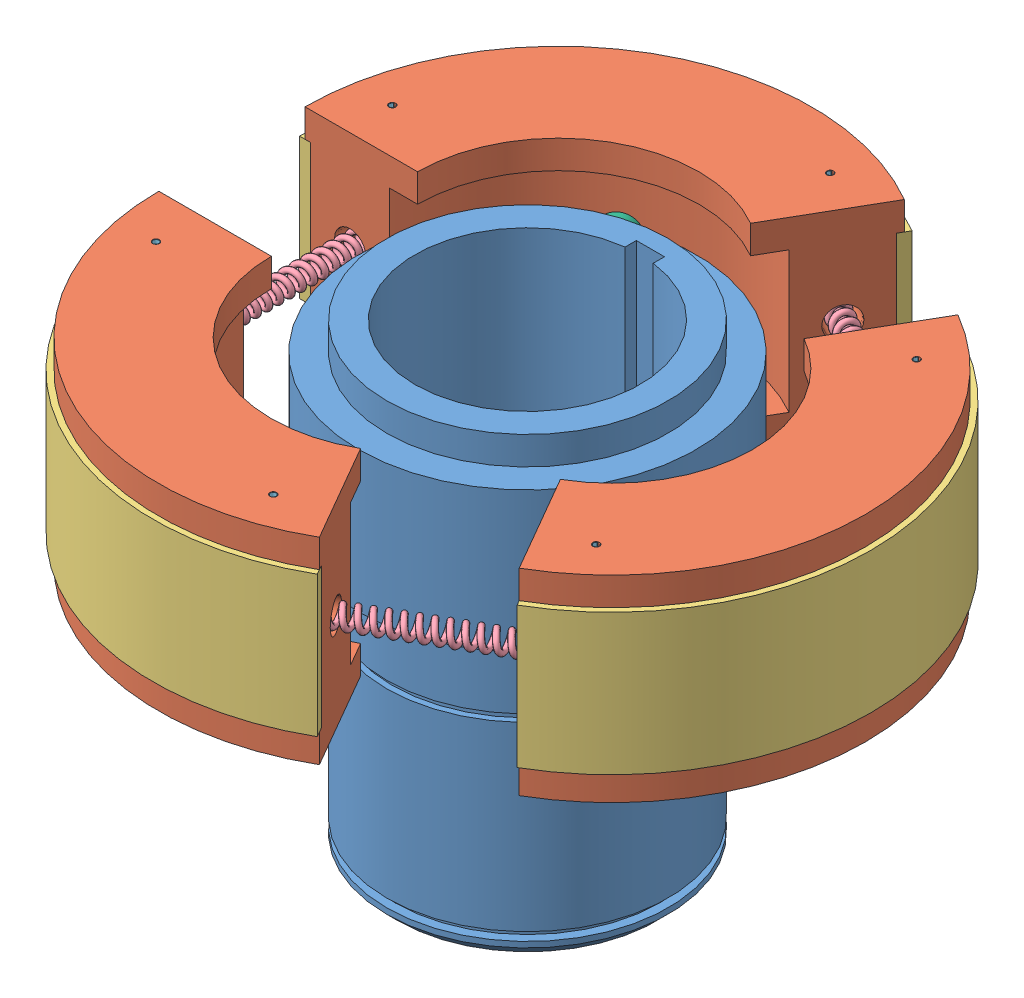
SolidWorks assembly Assemblage Frein.SLDASM, configuration Défaut (file format 3400). Lengths in mm.
Overall size (131.34 81 117.99).
19 component instances, 6 part files, 39 mates.
Components (placement in the parent):
- Pièce 1-1: Pièce 1.SLDPRT [Défaut] at origin size (60 81 60)
- Pièce 2-1: Pièce 2.SLDPRT [Défaut] at (-7.5005 -4.4466 -12.989) x (0 0 -1) z (0 1 0) size (45 67.5 35)
- Frein-1: Frein.SLDPRT [Défaut] at (-7.5005 0.5534 -12.9957) x (0 0 -1) z (0 1 0) size (46 69 25)
- Pièce 2-2: Pièce 2.SLDPRT [Défaut] at (-7.5005 30.5534 12.989) x (0 0 1) z (0 -1 0) size (45 67.5 35)
- Pièce 2-3: Pièce 2.SLDPRT [Défaut] at (15.0009 -4.4466 -0.0011) x (0.866025 0 0.5) z (0 1 0) size (45 67.5 35)
- Frein-2: Frein.SLDPRT [Défaut] at (-7.5005 25.5534 12.9957) x (0 0 1) z (0 -1 0) size (46 69 25)
- Frein-3: Frein.SLDPRT [Défaut] at (15.0027 25.5534 -0.0022) x (0.866025 0 -0.5) z (0 -1 0) size (46 69 25)
- Ressort-1: Ressort.SLDPRT [Défaut] at (5.4583 13.0534 -48.2345) x (-0.866025 0 -0.5) z (-0.341124 -0.731121 0.590844) size (41.5 4 4)
- Goupille frein centrifuge-1: Goupille frein centrifuge.SLDPRT [Défaut] at (40.6791 -4.4466 -28.4771) x (1 0 0) z (0 1 0) size (1.2 1.16 35)
- Goupille frein centrifuge-2: Goupille frein centrifuge.SLDPRT [Défaut] at (40.6791 -4.4466 28.4748) x (1 0 0) z (0 1 0) size (1.2 1.16 35)
- Goupille frein centrifuge-3: Goupille frein centrifuge.SLDPRT [Défaut] at (4.3213 -4.4466 -49.465) x (1 0 0) z (0 1 0) size (1.2 1.16 35)
- Goupille frein centrifuge-4: Goupille frein centrifuge.SLDPRT [Défaut] at (-45.0005 -4.4466 -20.989) x (1 0 0) z (0 1 0) size (1.2 1.16 35)
- Goupille frein centrifuge-5: Goupille frein centrifuge.SLDPRT [Défaut] at (-45.0005 30.5534 20.989) x (1 0 0) z (0 -1 0) size (1.2 1.16 35)
- Goupille frein centrifuge-6: Goupille frein centrifuge.SLDPRT [Défaut] at (4.3213 30.5534 49.465) x (1 0 0) z (0 -1 0) size (1.2 1.16 35)
- Ressort-2: Ressort.SLDPRT [Défaut] at (-44.5005 13.0534 19.389) x (0 0 1) z (-0.211121 -0.97746 0) size (41.5 4 4)
- Ressort-3: Ressort.SLDPRT [Défaut] at (39.0435 13.0534 28.8418) x (0.866025 0 -0.5) z (0.5 0 0.866025) size (41.5 4 4)
- Pièce 3-1: Pièce 3.SLDPRT [Défaut] at (-11.5 13.0534 19.9186) x (0.866025 0 0.5) z (-0.5 0 0.866025) size (6.6 6.6 30)
- Pièce 3-2: Pièce 3.SLDPRT [Défaut] at (-26.5 13.0534 -45.8993) x (0.866025 0 -0.5) z (0.5 0 0.866025) size (6.6 6.6 30)
- Pièce 3-3: Pièce 3.SLDPRT [Défaut] at (23 13.0534 0) x (0 0.224992 -0.974361) z (1 0 0) size (6.6 6.6 30)
Mates (geometry in assembly coordinates):
- Coaxiale1: concentric anti-aligned: cylinder of Pièce 1-1; cylinder of Pièce 2-1
- Coïncidente1: coincident anti-aligned: plane of Pièce 1-1 through (30 25.5534 0) normal (0 1 0); plane of Pièce 2-1 through (-7.5005 25.5534 -12.989) normal (0 -1 0)
- Distance1: distance = 10 mm: cylinder of Pièce 1-1; moEndPointRef_w of Pièce 2-1
- Coaxiale3: concentric anti-aligned: cylinder of Pièce 2-1; cylinder of Frein-1
- Coïncidente8: coincident: cylinder of Pièce 2-1; line of Frein-1
- Coaxiale8: concentric anti-aligned: cylinder of Pièce 1-1; cylinder of Pièce 2-2
- Coïncidente9: coincident anti-aligned: plane of Pièce 1-1 through (25 0.5534 0) normal (0 -1 0); plane of Pièce 2-2 through (-7.5005 0.5534 12.989) normal (0 1 0)
- Distance2: distance = 10 mm: cylinder of Pièce 1-1; line of Pièce 2-2
- Coaxiale9: concentric anti-aligned: cylinder of Pièce 2-2; cylinder of Frein-2
- Coïncidente12: coincident: cylinder of Pièce 2-2; line of Frein-2
- Coaxiale10: concentric anti-aligned: cylinder of Pièce 1-1; cylinder of Pièce 2-3
- Coïncidente13: coincident anti-aligned: plane of Pièce 1-1 through (30 25.5534 0) normal (0 1 0); plane of Pièce 2-3 through (15.0009 25.5534 -0.0011) normal (0 -1 0)
- Distance3: distance = 10 mm: cylinder of Pièce 1-1; line of Pièce 2-3
- Coaxiale11: concentric anti-aligned: cylinder of Pièce 2-3; cylinder of Frein-3
- Coïncidente15: coincident: cylinder of Pièce 2-3; line of Frein-3
- Coaxiale12: concentric anti-aligned: cylinder of Pièce 2-3; cylinder of Ressort-1
- Coaxiale19: concentric anti-aligned: cylinder of Pièce 2-2; cylinder of Goupille frein centrifuge-6
- Coïncidente23: coincident aligned: plane of Pièce 2-2 through (-7.5005 -4.4466 12.989) normal (0 -1 0); circle of Goupille frein centrifuge-6
- Coaxiale20: concentric anti-aligned: cylinder of Pièce 2-2; cylinder of Goupille frein centrifuge-5
- Coïncidente24: coincident aligned: plane of Pièce 2-2 through (-7.5005 30.5534 12.989) normal (0 1 0); circle of Goupille frein centrifuge-5
- Coaxiale21: concentric anti-aligned: cylinder of Pièce 2-1; cylinder of Goupille frein centrifuge-4
- Coïncidente25: coincident aligned: plane of Pièce 2-1 through (-7.5005 -4.4466 -12.989) normal (0 -1 0); circle of Goupille frein centrifuge-4
- Coaxiale22: concentric anti-aligned: cylinder of Pièce 2-1; cylinder of Goupille frein centrifuge-3
- Coïncidente26: coincident aligned: plane of Pièce 2-1 through (-7.5005 -4.4466 -12.989) normal (0 -1 0); circle of Goupille frein centrifuge-3
- Coaxiale23: concentric anti-aligned: cylinder of Pièce 2-3; cylinder of Goupille frein centrifuge-1
- Coïncidente27: coincident aligned: plane of Pièce 2-3 through (15.0009 -4.4466 -0.0011) normal (0 -1 0); circle of Goupille frein centrifuge-1
- Coaxiale24: concentric anti-aligned: cylinder of Pièce 2-3; cylinder of Goupille frein centrifuge-2
- Coïncidente28: coincident aligned: plane of Pièce 2-3 through (15.0009 -4.4466 -0.0011) normal (0 -1 0); circle of Goupille frein centrifuge-2
- Tangent3: tangent anti-aligned: plane of Ressort-1 through (4.5923 13.0534 -48.7345) normal (-0.866025 0 -0.5); cylinder of Goupille frein centrifuge-3
- Coaxiale25: concentric aligned: cylinder of Pièce 2-2; cylinder of Ressort-2
- Tangent4: tangent anti-aligned: cylinder of Goupille frein centrifuge-5; plane of Ressort-2 through (-44.5005 13.0534 20.389) normal (0 0 1)
- Coaxiale26: concentric aligned: cylinder of Pièce 2-3; cylinder of Ressort-3
- Tangent5: tangent anti-aligned: cylinder of Goupille frein centrifuge-2; plane of Ressort-3 through (39.9095 13.0534 28.3418) normal (0.866025 0 -0.5)
- Coaxiale28: concentric anti-aligned: cylinder of Pièce 1-1; cylinder of Pièce 3-1
- Coïncidente29: coincident anti-aligned: circle of Pièce 1-1; plane of Pièce 3-1 through (-11.5 13.0534 19.9186) normal (0.5 0 -0.866025)
- Coaxiale30: concentric anti-aligned: cylinder of Pièce 1-1; cylinder of Pièce 3-3
- Coïncidente30: coincident anti-aligned: circle of Pièce 1-1; plane of Pièce 3-3 through (23 13.0534 0) normal (-1 0 0)
- Coaxiale31: concentric anti-aligned: cylinder of Pièce 2-1; cylinder of Pièce 3-2
- Coïncidente31: coincident anti-aligned: circle of Pièce 1-1; plane of Pièce 3-2 through (-11.5 13.0534 -19.9186) normal (0.5 0 0.866025)
